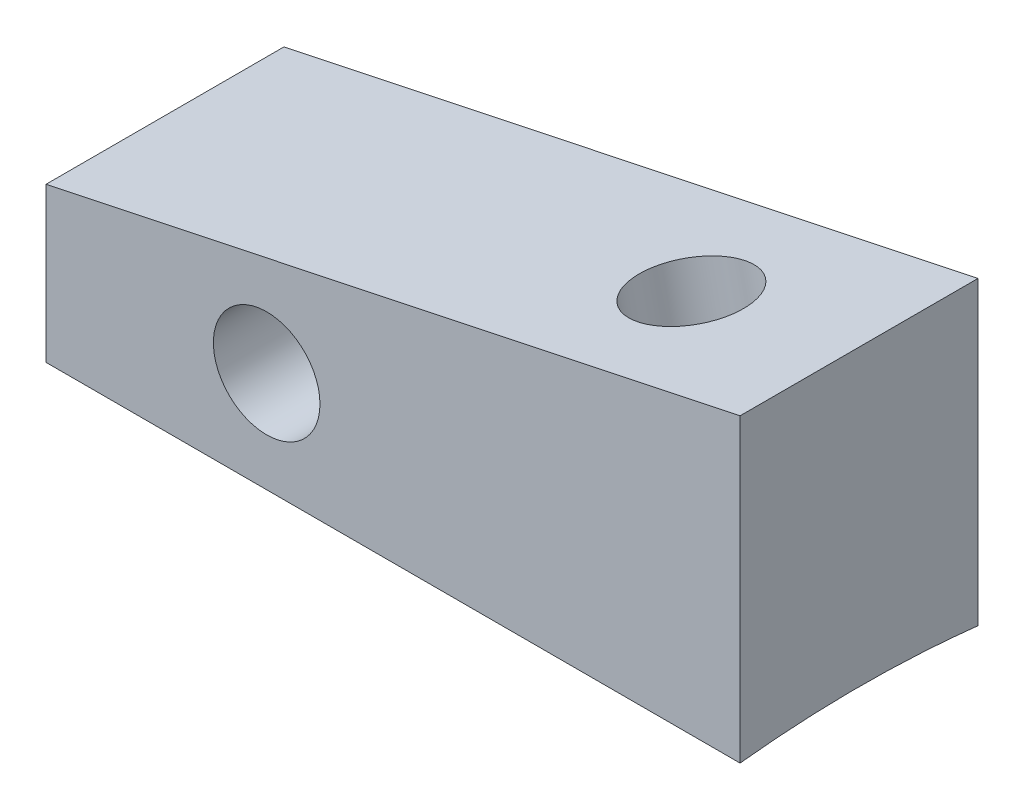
ISO-10303-21;
HEADER;
FILE_DESCRIPTION(('STEP AP214'),'2;1');
FILE_NAME('part.step','',(''),(''),'','','');
FILE_SCHEMA(('AUTOMOTIVE_DESIGN { 1 0 10303 214 1 1 1 1 }'));
ENDSEC;
DATA;
#1=APPLICATION_CONTEXT('core data for automotive mechanical design processes');
#2=APPLICATION_PROTOCOL_DEFINITION('international standard','automotive_design',2000,#1);
#3=PRODUCT_CONTEXT('',#1,'mechanical');
#4=PRODUCT('Part','Part','',(#3));
#5=PRODUCT_RELATED_PRODUCT_CATEGORY('part','',(#4));
#6=PRODUCT_DEFINITION_FORMATION('','',#4);
#7=PRODUCT_DEFINITION_CONTEXT('part definition',#1,'design');
#8=PRODUCT_DEFINITION('design','',#6,#7);
#9=PRODUCT_DEFINITION_SHAPE('','',#8);
#10=(LENGTH_UNIT() NAMED_UNIT(*) SI_UNIT(.MILLI.,.METRE.));
#11=(NAMED_UNIT(*) PLANE_ANGLE_UNIT() SI_UNIT($,.RADIAN.));
#12=(NAMED_UNIT(*) SI_UNIT($,.STERADIAN.) SOLID_ANGLE_UNIT());
#13=UNCERTAINTY_MEASURE_WITH_UNIT(LENGTH_MEASURE(1.E-05),#10,'distance_accuracy_value','');
#14=(GEOMETRIC_REPRESENTATION_CONTEXT(3) GLOBAL_UNCERTAINTY_ASSIGNED_CONTEXT((#13)) GLOBAL_UNIT_ASSIGNED_CONTEXT((#10,
#11,#12)) REPRESENTATION_CONTEXT('',''));
#15=CARTESIAN_POINT('',(0.,0.,0.));
#16=DIRECTION('',(0.,0.,1.));
#17=DIRECTION('',(1.,0.,0.));
#18=AXIS2_PLACEMENT_3D('',#15,#16,#17);
#19=CARTESIAN_POINT('',(-0.000681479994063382,8.02639997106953,0.));
#20=DIRECTION('',(0.,0.,-1.));
#21=DIRECTION('',(-1.,0.,0.));
#22=AXIS2_PLACEMENT_3D('',#19,#20,#21);
#23=PLANE('',#22);
#24=DIRECTION('',(-0.978440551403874,-0.206528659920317,0.));
#25=VECTOR('',#24,1.);
#26=CARTESIAN_POINT('',(-0.000681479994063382,8.02639997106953,0.));
#27=LINE('',#26,#25);
#28=CARTESIAN_POINT('',(-0.000681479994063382,8.02639997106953,0.));
#29=VERTEX_POINT('',#28);
#30=CARTESIAN_POINT('',(-18.5226298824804,4.11679792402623,0.));
#31=VERTEX_POINT('',#30);
#32=EDGE_CURVE('E88',#29,#31,#27,.T.);
#33=ORIENTED_EDGE('',*,*,#32,.F.);
#34=DIRECTION('',(-8.49048133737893E-05,0.999999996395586,0.));
#35=VECTOR('',#34,1.);
#36=CARTESIAN_POINT('',(0.,0.,0.));
#37=LINE('',#36,#35);
#38=CARTESIAN_POINT('',(0.,0.,0.));
#39=VERTEX_POINT('',#38);
#40=EDGE_CURVE('E92',#39,#29,#37,.T.);
#41=ORIENTED_EDGE('',*,*,#40,.F.);
#42=DIRECTION('',(1.,0.,0.));
#43=VECTOR('',#42,1.);
#44=CARTESIAN_POINT('',(-18.5226298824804,0.,0.));
#45=LINE('',#44,#43);
#46=CARTESIAN_POINT('',(-18.5226298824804,0.,0.));
#47=VERTEX_POINT('',#46);
#48=EDGE_CURVE('E75',#47,#39,#45,.T.);
#49=ORIENTED_EDGE('',*,*,#48,.F.);
#50=DIRECTION('',(0.,-1.,0.));
#51=VECTOR('',#50,1.);
#52=CARTESIAN_POINT('',(-18.5226298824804,4.11679792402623,0.));
#53=LINE('',#52,#51);
#54=EDGE_CURVE('E82',#31,#47,#53,.T.);
#55=ORIENTED_EDGE('',*,*,#54,.F.);
#56=EDGE_LOOP('',(#33,#41,#49,#55));
#57=FACE_BOUND('',#56,.T.);
#58=CARTESIAN_POINT('',(-12.6334123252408,2.6924,0.));
#59=DIRECTION('',(0.,0.,1.));
#60=DIRECTION('',(1.,0.,0.));
#61=AXIS2_PLACEMENT_3D('',#58,#59,#60);
#62=CIRCLE('',#61,1.4224);
#63=CARTESIAN_POINT('',(-11.2110123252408,2.6924,0.));
#64=VERTEX_POINT('',#63);
#65=EDGE_CURVE('E192',#64,#64,#62,.T.);
#66=ORIENTED_EDGE('',*,*,#65,.T.);
#67=EDGE_LOOP('',(#66));
#68=FACE_BOUND('',#67,.T.);
#69=ADVANCED_FACE('F31',(#57,#68),#23,.T.);
#70=CARTESIAN_POINT('',(-0.000681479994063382,8.02639997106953,6.35));
#71=DIRECTION('',(0.206528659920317,-0.978440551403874,0.));
#72=DIRECTION('',(0.978440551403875,0.206528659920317,0.));
#73=AXIS2_PLACEMENT_3D('',#70,#71,#72);
#74=PLANE('',#73);
#75=CARTESIAN_POINT('',(-4.47411168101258,7.08215093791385,3.175));
#76=DIRECTION('',(-0.206528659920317,0.978440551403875,0.));
#77=DIRECTION('',(-0.978440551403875,-0.206528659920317,0.));
#78=AXIS2_PLACEMENT_3D('',#75,#76,#77);
#79=CIRCLE('',#78,1.42239999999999);
#80=CARTESIAN_POINT('',(-5.86584552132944,6.78838457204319,3.175));
#81=VERTEX_POINT('',#80);
#82=EDGE_CURVE('E186',#81,#81,#79,.T.);
#83=ORIENTED_EDGE('',*,*,#82,.F.);
#84=EDGE_LOOP('',(#83));
#85=FACE_BOUND('',#84,.T.);
#86=ORIENTED_EDGE('',*,*,#32,.T.);
#87=DIRECTION('',(0.,0.,-1.));
#88=VECTOR('',#87,1.);
#89=CARTESIAN_POINT('',(-18.5226298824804,4.11679792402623,6.35));
#90=LINE('',#89,#88);
#91=CARTESIAN_POINT('',(-18.5226298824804,4.11679792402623,6.35));
#92=VERTEX_POINT('',#91);
#93=EDGE_CURVE('E11',#92,#31,#90,.T.);
#94=ORIENTED_EDGE('',*,*,#93,.F.);
#95=DIRECTION('',(-0.978440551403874,-0.206528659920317,0.));
#96=VECTOR('',#95,1.);
#97=CARTESIAN_POINT('',(-0.000681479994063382,8.02639997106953,6.35));
#98=LINE('',#97,#96);
#99=CARTESIAN_POINT('',(-0.000681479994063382,8.02639997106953,6.35));
#100=VERTEX_POINT('',#99);
#101=EDGE_CURVE('E94',#100,#92,#98,.T.);
#102=ORIENTED_EDGE('',*,*,#101,.F.);
#103=DIRECTION('',(0.,0.,-1.));
#104=VECTOR('',#103,1.);
#105=CARTESIAN_POINT('',(-0.000681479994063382,8.02639997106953,6.35));
#106=LINE('',#105,#104);
#107=EDGE_CURVE('E41',#100,#29,#106,.T.);
#108=ORIENTED_EDGE('',*,*,#107,.T.);
#109=EDGE_LOOP('',(#86,#94,#102,#108));
#110=FACE_BOUND('',#109,.T.);
#111=ADVANCED_FACE('F33',(#85,#110),#74,.F.);
#112=CARTESIAN_POINT('',(-18.5226298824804,4.11679792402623,6.35));
#113=DIRECTION('',(1.,0.,0.));
#114=DIRECTION('',(0.,0.,-1.));
#115=AXIS2_PLACEMENT_3D('',#112,#113,#114);
#116=PLANE('',#115);
#117=ORIENTED_EDGE('',*,*,#54,.T.);
#118=CARTESIAN_POINT('',(-18.5226298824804,-28.3980633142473,3.175));
#119=DIRECTION('',(-1.,0.,0.));
#120=DIRECTION('',(0.,0.,-1.));
#121=AXIS2_PLACEMENT_3D('',#118,#119,#120);
#122=CIRCLE('',#121,28.575);
#123=CARTESIAN_POINT('',(-18.5226298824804,0.,6.35));
#124=VERTEX_POINT('',#123);
#125=EDGE_CURVE('E71',#124,#47,#122,.T.);
#126=ORIENTED_EDGE('',*,*,#125,.F.);
#127=DIRECTION('',(0.,-1.,0.));
#128=VECTOR('',#127,1.);
#129=CARTESIAN_POINT('',(-18.5226298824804,4.11679792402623,6.35));
#130=LINE('',#129,#128);
#131=EDGE_CURVE('E98',#92,#124,#130,.T.);
#132=ORIENTED_EDGE('',*,*,#131,.F.);
#133=ORIENTED_EDGE('',*,*,#93,.T.);
#134=EDGE_LOOP('',(#117,#126,#132,#133));
#135=FACE_BOUND('',#134,.T.);
#136=ADVANCED_FACE('F83',(#135),#116,.F.);
#137=CARTESIAN_POINT('',(0.,0.,6.35));
#138=DIRECTION('',(-0.999999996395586,-8.49048133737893E-05,0.));
#139=DIRECTION('',(8.49048133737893E-05,-0.999999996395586,0.));
#140=AXIS2_PLACEMENT_3D('',#137,#138,#139);
#141=PLANE('',#140);
#142=DIRECTION('',(-8.49048133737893E-05,0.999999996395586,0.));
#143=VECTOR('',#142,1.);
#144=CARTESIAN_POINT('',(0.,0.,6.35));
#145=LINE('',#144,#143);
#146=CARTESIAN_POINT('',(0.,0.,6.35));
#147=VERTEX_POINT('',#146);
#148=EDGE_CURVE('E50',#147,#100,#145,.T.);
#149=ORIENTED_EDGE('',*,*,#148,.F.);
#150=CARTESIAN_POINT('',(0.00241113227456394,-28.3980633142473,3.175));
#151=DIRECTION('',(-0.999999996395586,-8.49048133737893E-05,0.));
#152=DIRECTION('',(-8.49048133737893E-05,0.999999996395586,0.));
#153=AXIS2_PLACEMENT_3D('',#150,#151,#152);
#154=ELLIPSE('',#153,28.5750001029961,28.575);
#155=EDGE_CURVE('E35',#147,#39,#154,.T.);
#156=ORIENTED_EDGE('',*,*,#155,.T.);
#157=ORIENTED_EDGE('',*,*,#40,.T.);
#158=ORIENTED_EDGE('',*,*,#107,.F.);
#159=EDGE_LOOP('',(#149,#156,#157,#158));
#160=FACE_BOUND('',#159,.T.);
#161=ADVANCED_FACE('F130',(#160),#141,.F.);
#162=CARTESIAN_POINT('',(-0.000681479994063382,8.02639997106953,6.35));
#163=DIRECTION('',(0.,0.,-1.));
#164=DIRECTION('',(-1.,0.,0.));
#165=AXIS2_PLACEMENT_3D('',#162,#163,#164);
#166=PLANE('',#165);
#167=CARTESIAN_POINT('',(-12.6334123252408,2.6924,6.35));
#168=DIRECTION('',(0.,0.,1.));
#169=DIRECTION('',(1.,0.,0.));
#170=AXIS2_PLACEMENT_3D('',#167,#168,#169);
#171=CIRCLE('',#170,1.42239999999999);
#172=CARTESIAN_POINT('',(-11.2110123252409,2.6924,6.35));
#173=VERTEX_POINT('',#172);
#174=EDGE_CURVE('E189',#173,#173,#171,.T.);
#175=ORIENTED_EDGE('',*,*,#174,.F.);
#176=EDGE_LOOP('',(#175));
#177=FACE_BOUND('',#176,.T.);
#178=ORIENTED_EDGE('',*,*,#101,.T.);
#179=ORIENTED_EDGE('',*,*,#131,.T.);
#180=DIRECTION('',(1.,0.,0.));
#181=VECTOR('',#180,1.);
#182=CARTESIAN_POINT('',(-18.5226298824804,0.,6.35));
#183=LINE('',#182,#181);
#184=EDGE_CURVE('E77',#124,#147,#183,.T.);
#185=ORIENTED_EDGE('',*,*,#184,.T.);
#186=ORIENTED_EDGE('',*,*,#148,.T.);
#187=EDGE_LOOP('',(#178,#179,#185,#186));
#188=FACE_BOUND('',#187,.T.);
#189=ADVANCED_FACE('F118',(#177,#188),#166,.F.);
#190=CARTESIAN_POINT('',(-4.47411168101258,7.08215093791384,3.175));
#191=DIRECTION('',(-0.206528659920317,0.978440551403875,0.));
#192=DIRECTION('',(-0.978440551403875,-0.206528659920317,0.));
#193=AXIS2_PLACEMENT_3D('',#190,#191,#192);
#194=CYLINDRICAL_SURFACE('',#193,1.42239999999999);
#195=CARTESIAN_POINT('',(-4.47030496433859,0.176936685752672,3.175));
#196=CARTESIAN_POINT('',(-4.47030102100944,0.176936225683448,3.09693363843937));
#197=CARTESIAN_POINT('',(-4.46364252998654,0.176613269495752,3.01881031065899));
#198=CARTESIAN_POINT('',(-4.43721864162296,0.17535665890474,2.86475644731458));
#199=CARTESIAN_POINT('',(-4.41743749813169,0.174422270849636,2.78882866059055));
#200=CARTESIAN_POINT('',(-4.36547237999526,0.172050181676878,2.6414592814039));
#201=CARTESIAN_POINT('',(-4.33330387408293,0.170613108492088,2.57001222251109));
#202=CARTESIAN_POINT('',(-4.25762393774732,0.167394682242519,2.433442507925));
#203=CARTESIAN_POINT('',(-4.21411438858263,0.165613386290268,2.36831880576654));
#204=CARTESIAN_POINT('',(-4.11632030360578,0.161868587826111,2.24506340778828));
#205=CARTESIAN_POINT('',(-4.06187693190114,0.159902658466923,2.18705791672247));
#206=CARTESIAN_POINT('',(-3.94427114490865,0.156024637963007,2.08068453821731));
#207=CARTESIAN_POINT('',(-3.88110722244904,0.154112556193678,2.03231832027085));
#208=CARTESIAN_POINT('',(-3.74583255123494,0.150490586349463,1.94509624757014));
#209=CARTESIAN_POINT('',(-3.67351164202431,0.148788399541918,1.90656588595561));
#210=CARTESIAN_POINT('',(-3.52351561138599,0.145841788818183,1.84189878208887));
#211=CARTESIAN_POINT('',(-3.44583980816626,0.14459742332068,1.81576362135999));
#212=CARTESIAN_POINT('',(-3.28560683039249,0.142683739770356,1.776147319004));
#213=CARTESIAN_POINT('',(-3.20298195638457,0.142026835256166,1.76293880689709));
#214=CARTESIAN_POINT('',(-3.03668077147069,0.141409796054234,1.75052138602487));
#215=CARTESIAN_POINT('',(-2.95300442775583,0.141449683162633,1.75131291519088));
#216=CARTESIAN_POINT('',(-2.78676669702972,0.142226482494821,1.76697153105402));
#217=CARTESIAN_POINT('',(-2.70420858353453,0.142965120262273,1.78187346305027));
#218=CARTESIAN_POINT('',(-2.54283050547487,0.145060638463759,1.82549162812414));
#219=CARTESIAN_POINT('',(-2.46401032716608,0.146417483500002,1.85420707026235));
#220=CARTESIAN_POINT('',(-2.31343100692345,0.149573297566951,1.92428946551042));
#221=CARTESIAN_POINT('',(-2.24159514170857,0.151366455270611,1.96549174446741));
#222=CARTESIAN_POINT('',(-2.10603564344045,0.155196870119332,2.05957814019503));
#223=CARTESIAN_POINT('',(-2.04231122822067,0.157234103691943,2.11246112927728));
#224=CARTESIAN_POINT('',(-1.92598757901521,0.161276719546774,2.22739207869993));
#225=CARTESIAN_POINT('',(-1.87321017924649,0.163282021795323,2.2892597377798));
#226=CARTESIAN_POINT('',(-1.77897777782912,0.167065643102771,2.42109554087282));
#227=CARTESIAN_POINT('',(-1.73752182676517,0.168843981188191,2.49106300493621));
#228=CARTESIAN_POINT('',(-1.66772529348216,0.171943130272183,2.63599399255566));
#229=CARTESIAN_POINT('',(-1.63920025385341,0.173270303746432,2.71086858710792));
#230=CARTESIAN_POINT('',(-1.59523501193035,0.175351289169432,2.86437292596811));
#231=CARTESIAN_POINT('',(-1.57979410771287,0.176105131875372,2.94300246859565));
#232=CARTESIAN_POINT('',(-1.56253659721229,0.176949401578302,3.10106783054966));
#233=CARTESIAN_POINT('',(-1.56060537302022,0.177045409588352,3.18049112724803));
#234=CARTESIAN_POINT('',(-1.57012053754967,0.176578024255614,3.33852902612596));
#235=CARTESIAN_POINT('',(-1.58156661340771,0.176014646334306,3.41714364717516));
#236=CARTESIAN_POINT('',(-1.6174558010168,0.174294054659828,3.57115811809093));
#237=CARTESIAN_POINT('',(-1.64187054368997,0.17313813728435,3.64656459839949));
#238=CARTESIAN_POINT('',(-1.70295753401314,0.170362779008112,3.79222557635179));
#239=CARTESIAN_POINT('',(-1.73962984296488,0.168743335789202,3.8624800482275));
#240=CARTESIAN_POINT('',(-1.82431976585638,0.16521434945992,3.9961505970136));
#241=CARTESIAN_POINT('',(-1.87238053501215,0.163303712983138,4.05953929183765));
#242=CARTESIAN_POINT('',(-1.97836624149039,0.159408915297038,4.17744294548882));
#243=CARTESIAN_POINT('',(-2.036291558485,0.157424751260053,4.23195756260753));
#244=CARTESIAN_POINT('',(-2.16097087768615,0.153580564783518,4.33118081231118));
#245=CARTESIAN_POINT('',(-2.22780815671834,0.151721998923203,4.37578482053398));
#246=CARTESIAN_POINT('',(-2.36793580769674,0.148354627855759,4.45334281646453));
#247=CARTESIAN_POINT('',(-2.44122665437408,0.146845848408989,4.48629594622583));
#248=CARTESIAN_POINT('',(-2.59340818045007,0.144319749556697,4.54018805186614));
#249=CARTESIAN_POINT('',(-2.67236886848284,0.143310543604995,4.56092966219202));
#250=CARTESIAN_POINT('',(-2.83263279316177,0.14192741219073,4.58912698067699));
#251=CARTESIAN_POINT('',(-2.913936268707,0.141553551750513,4.5965813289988));
#252=CARTESIAN_POINT('',(-3.07808674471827,0.141477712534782,4.59810394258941));
#253=CARTESIAN_POINT('',(-3.1609359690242,0.141787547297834,4.59193684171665));
#254=CARTESIAN_POINT('',(-3.32446371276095,0.143065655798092,4.56595230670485));
#255=CARTESIAN_POINT('',(-3.40514204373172,0.144033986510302,4.54613369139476));
#256=CARTESIAN_POINT('',(-3.56291353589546,0.146532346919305,4.49310164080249));
#257=CARTESIAN_POINT('',(-3.63996001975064,0.148068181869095,4.45974940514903));
#258=CARTESIAN_POINT('',(-3.78731315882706,0.151523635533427,4.38051868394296));
#259=CARTESIAN_POINT('',(-3.85762004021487,0.153443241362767,4.33464061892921));
#260=CARTESIAN_POINT('',(-3.98897351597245,0.157431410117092,4.23186676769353));
#261=CARTESIAN_POINT('',(-4.05007373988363,0.1594989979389,4.17503956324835));
#262=CARTESIAN_POINT('',(-4.16159349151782,0.163551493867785,4.05168766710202));
#263=CARTESIAN_POINT('',(-4.21201172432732,0.165536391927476,3.98516180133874));
#264=CARTESIAN_POINT('',(-4.29938954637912,0.169140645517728,3.84597808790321));
#265=CARTESIAN_POINT('',(-4.33663904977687,0.170767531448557,3.77350231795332));
#266=CARTESIAN_POINT('',(-4.39797384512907,0.173519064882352,3.62324339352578));
#267=CARTESIAN_POINT('',(-4.42207827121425,0.174644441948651,3.54546813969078));
#268=CARTESIAN_POINT('',(-4.44952077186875,0.175940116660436,3.41842562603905));
#269=CARTESIAN_POINT('',(-4.45730296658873,0.176312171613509,3.37007761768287));
#270=CARTESIAN_POINT('',(-4.46769625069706,0.176810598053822,3.27282719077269));
#271=CARTESIAN_POINT('',(-4.47030743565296,0.176936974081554,3.22392478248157));
#272=CARTESIAN_POINT('',(-4.47030496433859,0.176936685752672,3.175));
#273=B_SPLINE_CURVE_WITH_KNOTS('',3,(#195,#196,#197,#198,#199,#200,#201,#202,#203,#204,#205,
#206,#207,#208,#209,#210,#211,#212,#213,#214,#215,#216,#217,#218,#219,#220,#221,#222,#223,#224,
#225,#226,#227,#228,#229,#230,#231,#232,#233,#234,#235,#236,#237,#238,#239,#240,#241,#242,#243,
#244,#245,#246,#247,#248,#249,#250,#251,#252,#253,#254,#255,#256,#257,#258,#259,#260,#261,#262,
#263,#264,#265,#266,#267,#268,#269,#270,#271,#272),.UNSPECIFIED.,.T.,.F.,(4,2,2,2,2,2,2,2,2,2,2,
2,2,2,2,2,2,2,2,2,2,2,2,2,2,2,2,2,2,2,2,2,2,2,2,2,2,2,4),(0.,0.234017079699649,
0.468315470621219,0.702322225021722,0.93629018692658,1.173941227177,1.41163339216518,
1.65639215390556,1.90118213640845,2.15103022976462,2.40088613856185,2.65136067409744,
2.9018208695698,3.14911204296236,3.39637935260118,3.63923614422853,3.88207256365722,
4.12132663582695,4.36056787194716,4.59777686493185,4.83498031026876,5.07166699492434,
5.30835486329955,5.5459543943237,5.78356307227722,6.02357209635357,6.26359879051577,
6.50740532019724,6.75123679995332,6.99931436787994,7.24741340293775,7.49812397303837,
7.74882612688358,7.99800621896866,8.2472165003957,8.49053707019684,8.73350250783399,
8.88016550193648,9.02682578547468),.UNSPECIFIED.);
#274=CARTESIAN_POINT('',(-4.47030496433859,0.176936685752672,3.175));
#275=VERTEX_POINT('',#274);
#276=EDGE_CURVE('E80',#275,#275,#273,.T.);
#277=ORIENTED_EDGE('',*,*,#276,.T.);
#278=EDGE_LOOP('',(#277));
#279=FACE_BOUND('',#278,.T.);
#280=ORIENTED_EDGE('',*,*,#82,.T.);
#281=EDGE_LOOP('',(#280));
#282=FACE_BOUND('',#281,.T.);
#283=ADVANCED_FACE('F105',(#279,#282),#194,.F.);
#284=CARTESIAN_POINT('',(-12.6334123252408,2.6924,6.35));
#285=DIRECTION('',(0.,0.,1.));
#286=DIRECTION('',(1.,0.,0.));
#287=AXIS2_PLACEMENT_3D('',#284,#285,#286);
#288=CYLINDRICAL_SURFACE('',#287,1.42239999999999);
#289=ORIENTED_EDGE('',*,*,#65,.F.);
#290=EDGE_LOOP('',(#289));
#291=FACE_BOUND('',#290,.T.);
#292=ORIENTED_EDGE('',*,*,#174,.T.);
#293=EDGE_LOOP('',(#292));
#294=FACE_BOUND('',#293,.T.);
#295=ADVANCED_FACE('F111',(#291,#294),#288,.F.);
#296=CARTESIAN_POINT('',(0.,-28.3980633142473,3.175));
#297=DIRECTION('',(-1.,0.,0.));
#298=DIRECTION('',(0.,0.,1.));
#299=AXIS2_PLACEMENT_3D('',#296,#297,#298);
#300=CYLINDRICAL_SURFACE('',#299,28.575);
#301=ORIENTED_EDGE('',*,*,#276,.F.);
#302=EDGE_LOOP('',(#301));
#303=FACE_BOUND('',#302,.T.);
#304=ORIENTED_EDGE('',*,*,#184,.F.);
#305=ORIENTED_EDGE('',*,*,#125,.T.);
#306=ORIENTED_EDGE('',*,*,#48,.T.);
#307=ORIENTED_EDGE('',*,*,#155,.F.);
#308=EDGE_LOOP('',(#304,#305,#306,#307));
#309=FACE_BOUND('',#308,.T.);
#310=ADVANCED_FACE('F73',(#303,#309),#300,.F.);
#311=CLOSED_SHELL('',(#69,#111,#136,#161,#189,#283,#295,#310));
#312=MANIFOLD_SOLID_BREP('B2',#311);
#313=ADVANCED_BREP_SHAPE_REPRESENTATION('',(#18,#312),#14);
#314=SHAPE_DEFINITION_REPRESENTATION(#9,#313);
ENDSEC;
END-ISO-10303-21;
